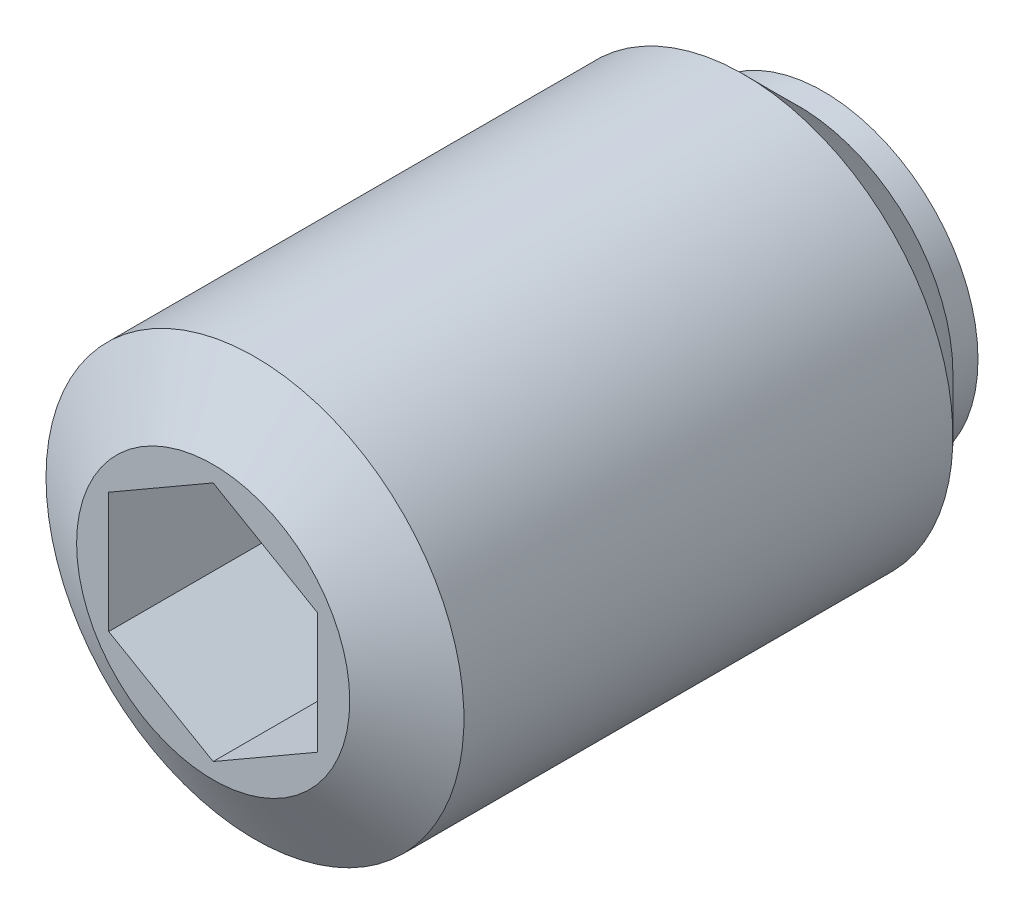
ISO-10303-21;
HEADER;
FILE_DESCRIPTION(('STEP AP214'),'2;1');
FILE_NAME('part.step','',(''),(''),'','','');
FILE_SCHEMA(('AUTOMOTIVE_DESIGN { 1 0 10303 214 1 1 1 1 }'));
ENDSEC;
DATA;
#1=APPLICATION_CONTEXT('core data for automotive mechanical design processes');
#2=APPLICATION_PROTOCOL_DEFINITION('international standard','automotive_design',2000,#1);
#3=PRODUCT_CONTEXT('',#1,'mechanical');
#4=PRODUCT('Part','Part','',(#3));
#5=PRODUCT_RELATED_PRODUCT_CATEGORY('part','',(#4));
#6=PRODUCT_DEFINITION_FORMATION('','',#4);
#7=PRODUCT_DEFINITION_CONTEXT('part definition',#1,'design');
#8=PRODUCT_DEFINITION('design','',#6,#7);
#9=PRODUCT_DEFINITION_SHAPE('','',#8);
#10=(LENGTH_UNIT() NAMED_UNIT(*) SI_UNIT(.MILLI.,.METRE.));
#11=(NAMED_UNIT(*) PLANE_ANGLE_UNIT() SI_UNIT($,.RADIAN.));
#12=(NAMED_UNIT(*) SI_UNIT($,.STERADIAN.) SOLID_ANGLE_UNIT());
#13=UNCERTAINTY_MEASURE_WITH_UNIT(LENGTH_MEASURE(1.E-05),#10,'distance_accuracy_value','');
#14=(GEOMETRIC_REPRESENTATION_CONTEXT(3) GLOBAL_UNCERTAINTY_ASSIGNED_CONTEXT((#13)) GLOBAL_UNIT_ASSIGNED_CONTEXT((#10,
#11,#12)) REPRESENTATION_CONTEXT('',''));
#15=CARTESIAN_POINT('',(0.,0.,0.));
#16=DIRECTION('',(0.,0.,1.));
#17=DIRECTION('',(1.,0.,0.));
#18=AXIS2_PLACEMENT_3D('',#15,#16,#17);
#19=CARTESIAN_POINT('',(0.,0.,1.5));
#20=DIRECTION('',(0.,0.,1.));
#21=DIRECTION('',(0.,-1.,0.));
#22=AXIS2_PLACEMENT_3D('',#19,#20,#21);
#23=SPHERICAL_SURFACE('',#22,1.5);
#24=CARTESIAN_POINT('',(0.,0.,0.7));
#25=DIRECTION('',(0.,0.,1.));
#26=DIRECTION('',(-1.,0.,0.));
#27=AXIS2_PLACEMENT_3D('',#24,#25,#26);
#28=CIRCLE('',#27,1.26885775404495);
#29=CARTESIAN_POINT('',(-1.26885775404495,0.,0.7));
#30=VERTEX_POINT('',#29);
#31=EDGE_CURVE('E9',#30,#30,#28,.T.);
#32=ORIENTED_EDGE('',*,*,#31,.F.);
#33=EDGE_LOOP('',(#32));
#34=FACE_BOUND('',#33,.T.);
#35=ADVANCED_FACE('F14',(#34),#23,.T.);
#36=CARTESIAN_POINT('',(0.,1.85,0.7));
#37=DIRECTION('',(0.,0.,1.));
#38=DIRECTION('',(-1.,0.,0.));
#39=AXIS2_PLACEMENT_3D('',#36,#37,#38);
#40=PLANE('',#39);
#41=CARTESIAN_POINT('',(0.,0.,0.7));
#42=DIRECTION('',(0.,0.,1.));
#43=DIRECTION('',(-1.,0.,0.));
#44=AXIS2_PLACEMENT_3D('',#41,#42,#43);
#45=CIRCLE('',#44,1.85);
#46=CARTESIAN_POINT('',(-1.85,0.,0.7));
#47=VERTEX_POINT('',#46);
#48=EDGE_CURVE('E21',#47,#47,#45,.T.);
#49=ORIENTED_EDGE('',*,*,#48,.F.);
#50=EDGE_LOOP('',(#49));
#51=FACE_BOUND('',#50,.T.);
#52=ORIENTED_EDGE('',*,*,#31,.T.);
#53=EDGE_LOOP('',(#52));
#54=FACE_BOUND('',#53,.T.);
#55=ADVANCED_FACE('F138',(#51,#54),#40,.F.);
#56=CARTESIAN_POINT('',(0.,0.,9.39507492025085));
#57=DIRECTION('',(0.,0.,1.));
#58=DIRECTION('',(-1.,0.,0.));
#59=AXIS2_PLACEMENT_3D('',#56,#57,#58);
#60=CYLINDRICAL_SURFACE('',#59,1.85);
#61=CARTESIAN_POINT('',(0.,0.,1.));
#62=DIRECTION('',(0.,0.,1.));
#63=DIRECTION('',(-1.,0.,0.));
#64=AXIS2_PLACEMENT_3D('',#61,#62,#63);
#65=CIRCLE('',#64,1.85);
#66=CARTESIAN_POINT('',(-1.85,0.,1.));
#67=VERTEX_POINT('',#66);
#68=EDGE_CURVE('E131',#67,#67,#65,.T.);
#69=ORIENTED_EDGE('',*,*,#68,.F.);
#70=EDGE_LOOP('',(#69));
#71=FACE_BOUND('',#70,.T.);
#72=ORIENTED_EDGE('',*,*,#48,.T.);
#73=EDGE_LOOP('',(#72));
#74=FACE_BOUND('',#73,.T.);
#75=ADVANCED_FACE('F136',(#71,#74),#60,.T.);
#76=CARTESIAN_POINT('',(0.,0.,1.));
#77=DIRECTION('',(0.,0.,1.));
#78=DIRECTION('',(-1.,0.,0.));
#79=AXIS2_PLACEMENT_3D('',#76,#77,#78);
#80=CONICAL_SURFACE('',#79,1.85,0.78539816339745);
#81=CARTESIAN_POINT('',(0.,0.,1.65));
#82=DIRECTION('',(0.,0.,1.));
#83=DIRECTION('',(-1.,0.,0.));
#84=AXIS2_PLACEMENT_3D('',#81,#82,#83);
#85=CIRCLE('',#84,2.5);
#86=CARTESIAN_POINT('',(-2.5,0.,1.65));
#87=VERTEX_POINT('',#86);
#88=EDGE_CURVE('E128',#87,#87,#85,.T.);
#89=ORIENTED_EDGE('',*,*,#88,.F.);
#90=EDGE_LOOP('',(#89));
#91=FACE_BOUND('',#90,.T.);
#92=ORIENTED_EDGE('',*,*,#68,.T.);
#93=EDGE_LOOP('',(#92));
#94=FACE_BOUND('',#93,.T.);
#95=ADVANCED_FACE('F161',(#91,#94),#80,.T.);
#96=CARTESIAN_POINT('',(0.,0.,9.39507492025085));
#97=DIRECTION('',(0.,0.,1.));
#98=DIRECTION('',(-1.,0.,0.));
#99=AXIS2_PLACEMENT_3D('',#96,#97,#98);
#100=CYLINDRICAL_SURFACE('',#99,2.5);
#101=CARTESIAN_POINT('',(0.,0.,7.5));
#102=DIRECTION('',(0.,0.,1.));
#103=DIRECTION('',(-1.,0.,0.));
#104=AXIS2_PLACEMENT_3D('',#101,#102,#103);
#105=CIRCLE('',#104,2.5);
#106=CARTESIAN_POINT('',(-2.5,0.,7.5));
#107=VERTEX_POINT('',#106);
#108=EDGE_CURVE('E125',#107,#107,#105,.T.);
#109=ORIENTED_EDGE('',*,*,#108,.F.);
#110=EDGE_LOOP('',(#109));
#111=FACE_BOUND('',#110,.T.);
#112=ORIENTED_EDGE('',*,*,#88,.T.);
#113=EDGE_LOOP('',(#112));
#114=FACE_BOUND('',#113,.T.);
#115=ADVANCED_FACE('F170',(#111,#114),#100,.T.);
#116=CARTESIAN_POINT('',(0.,0.,7.5));
#117=DIRECTION('',(0.,0.,-1.));
#118=DIRECTION('',(1.,0.,0.));
#119=AXIS2_PLACEMENT_3D('',#116,#117,#118);
#120=CONICAL_SURFACE('',#119,2.5,1.04719755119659);
#121=CARTESIAN_POINT('',(0.,0.,8.));
#122=DIRECTION('',(0.,0.,1.));
#123=DIRECTION('',(-1.,0.,0.));
#124=AXIS2_PLACEMENT_3D('',#121,#122,#123);
#125=CIRCLE('',#124,1.63397459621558);
#126=CARTESIAN_POINT('',(-1.63397459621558,0.,8.));
#127=VERTEX_POINT('',#126);
#128=EDGE_CURVE('E116',#127,#127,#125,.T.);
#129=ORIENTED_EDGE('',*,*,#128,.F.);
#130=EDGE_LOOP('',(#129));
#131=FACE_BOUND('',#130,.T.);
#132=ORIENTED_EDGE('',*,*,#108,.T.);
#133=EDGE_LOOP('',(#132));
#134=FACE_BOUND('',#133,.T.);
#135=ADVANCED_FACE('F179',(#131,#134),#120,.T.);
#136=CARTESIAN_POINT('',(0.,0.,8.));
#137=DIRECTION('',(0.,0.,-1.));
#138=DIRECTION('',(1.,0.,0.));
#139=AXIS2_PLACEMENT_3D('',#136,#137,#138);
#140=PLANE('',#139);
#141=DIRECTION('',(-0.866025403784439,-0.5,0.));
#142=VECTOR('',#141,1.);
#143=CARTESIAN_POINT('',(0.,1.44337567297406,8.));
#144=LINE('',#143,#142);
#145=CARTESIAN_POINT('',(0.,1.44337567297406,8.));
#146=VERTEX_POINT('',#145);
#147=CARTESIAN_POINT('',(-1.25,0.721687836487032,8.));
#148=VERTEX_POINT('',#147);
#149=EDGE_CURVE('E82',#146,#148,#144,.T.);
#150=ORIENTED_EDGE('',*,*,#149,.F.);
#151=DIRECTION('',(-0.866025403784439,0.5,0.));
#152=VECTOR('',#151,1.);
#153=CARTESIAN_POINT('',(1.25,0.721687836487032,8.));
#154=LINE('',#153,#152);
#155=CARTESIAN_POINT('',(1.25,0.721687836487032,8.));
#156=VERTEX_POINT('',#155);
#157=EDGE_CURVE('E28',#156,#146,#154,.T.);
#158=ORIENTED_EDGE('',*,*,#157,.F.);
#159=DIRECTION('',(0.,1.,0.));
#160=VECTOR('',#159,1.);
#161=CARTESIAN_POINT('',(1.25,-0.721687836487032,8.));
#162=LINE('',#161,#160);
#163=CARTESIAN_POINT('',(1.25,-0.721687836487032,8.));
#164=VERTEX_POINT('',#163);
#165=EDGE_CURVE('E98',#164,#156,#162,.T.);
#166=ORIENTED_EDGE('',*,*,#165,.F.);
#167=DIRECTION('',(0.866025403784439,0.5,0.));
#168=VECTOR('',#167,1.);
#169=CARTESIAN_POINT('',(0.,-1.44337567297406,8.));
#170=LINE('',#169,#168);
#171=CARTESIAN_POINT('',(0.,-1.44337567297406,8.));
#172=VERTEX_POINT('',#171);
#173=EDGE_CURVE('E92',#172,#164,#170,.T.);
#174=ORIENTED_EDGE('',*,*,#173,.F.);
#175=DIRECTION('',(0.866025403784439,-0.5,0.));
#176=VECTOR('',#175,1.);
#177=CARTESIAN_POINT('',(-1.25,-0.721687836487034,8.));
#178=LINE('',#177,#176);
#179=CARTESIAN_POINT('',(-1.25,-0.721687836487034,8.));
#180=VERTEX_POINT('',#179);
#181=EDGE_CURVE('E90',#180,#172,#178,.T.);
#182=ORIENTED_EDGE('',*,*,#181,.F.);
#183=DIRECTION('',(0.,-1.,0.));
#184=VECTOR('',#183,1.);
#185=CARTESIAN_POINT('',(-1.25,0.721687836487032,8.));
#186=LINE('',#185,#184);
#187=EDGE_CURVE('E71',#148,#180,#186,.T.);
#188=ORIENTED_EDGE('',*,*,#187,.F.);
#189=EDGE_LOOP('',(#150,#158,#166,#174,#182,#188));
#190=FACE_BOUND('',#189,.T.);
#191=ORIENTED_EDGE('',*,*,#128,.T.);
#192=EDGE_LOOP('',(#191));
#193=FACE_BOUND('',#192,.T.);
#194=ADVANCED_FACE('F86',(#190,#193),#140,.F.);
#195=CARTESIAN_POINT('',(1.25,0.721687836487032,5.));
#196=DIRECTION('',(0.5,0.866025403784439,0.));
#197=DIRECTION('',(0.866025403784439,-0.5,0.));
#198=AXIS2_PLACEMENT_3D('',#195,#196,#197);
#199=PLANE('',#198);
#200=ORIENTED_EDGE('',*,*,#157,.T.);
#201=DIRECTION('',(0.,0.,1.));
#202=VECTOR('',#201,1.);
#203=CARTESIAN_POINT('',(0.,1.44337567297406,5.));
#204=LINE('',#203,#202);
#205=CARTESIAN_POINT('',(0.,1.44337567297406,5.));
#206=VERTEX_POINT('',#205);
#207=EDGE_CURVE('E79',#206,#146,#204,.T.);
#208=ORIENTED_EDGE('',*,*,#207,.F.);
#209=DIRECTION('',(-0.866025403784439,0.5,0.));
#210=VECTOR('',#209,1.);
#211=CARTESIAN_POINT('',(1.25,0.721687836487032,5.));
#212=LINE('',#211,#210);
#213=CARTESIAN_POINT('',(1.25,0.721687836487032,5.));
#214=VERTEX_POINT('',#213);
#215=EDGE_CURVE('E100',#214,#206,#212,.T.);
#216=ORIENTED_EDGE('',*,*,#215,.F.);
#217=DIRECTION('',(0.,0.,1.));
#218=VECTOR('',#217,1.);
#219=CARTESIAN_POINT('',(1.25,0.721687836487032,5.));
#220=LINE('',#219,#218);
#221=EDGE_CURVE('E35',#214,#156,#220,.T.);
#222=ORIENTED_EDGE('',*,*,#221,.T.);
#223=EDGE_LOOP('',(#200,#208,#216,#222));
#224=FACE_BOUND('',#223,.T.);
#225=ADVANCED_FACE('F196',(#224),#199,.F.);
#226=CARTESIAN_POINT('',(1.25,-0.721687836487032,5.));
#227=DIRECTION('',(1.,0.,0.));
#228=DIRECTION('',(0.,-1.,0.));
#229=AXIS2_PLACEMENT_3D('',#226,#227,#228);
#230=PLANE('',#229);
#231=ORIENTED_EDGE('',*,*,#165,.T.);
#232=ORIENTED_EDGE('',*,*,#221,.F.);
#233=DIRECTION('',(0.,1.,0.));
#234=VECTOR('',#233,1.);
#235=CARTESIAN_POINT('',(1.25,-0.721687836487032,5.));
#236=LINE('',#235,#234);
#237=CARTESIAN_POINT('',(1.25,-0.721687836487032,5.));
#238=VERTEX_POINT('',#237);
#239=EDGE_CURVE('E112',#238,#214,#236,.T.);
#240=ORIENTED_EDGE('',*,*,#239,.F.);
#241=DIRECTION('',(0.,0.,1.));
#242=VECTOR('',#241,1.);
#243=CARTESIAN_POINT('',(1.25,-0.721687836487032,5.));
#244=LINE('',#243,#242);
#245=EDGE_CURVE('E117',#238,#164,#244,.T.);
#246=ORIENTED_EDGE('',*,*,#245,.T.);
#247=EDGE_LOOP('',(#231,#232,#240,#246));
#248=FACE_BOUND('',#247,.T.);
#249=ADVANCED_FACE('F204',(#248),#230,.F.);
#250=CARTESIAN_POINT('',(0.,-1.44337567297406,5.));
#251=DIRECTION('',(0.5,-0.866025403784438,0.));
#252=DIRECTION('',(-0.866025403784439,-0.5,0.));
#253=AXIS2_PLACEMENT_3D('',#250,#251,#252);
#254=PLANE('',#253);
#255=ORIENTED_EDGE('',*,*,#173,.T.);
#256=ORIENTED_EDGE('',*,*,#245,.F.);
#257=DIRECTION('',(0.866025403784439,0.5,0.));
#258=VECTOR('',#257,1.);
#259=CARTESIAN_POINT('',(0.,-1.44337567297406,5.));
#260=LINE('',#259,#258);
#261=CARTESIAN_POINT('',(0.,-1.44337567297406,5.));
#262=VERTEX_POINT('',#261);
#263=EDGE_CURVE('E109',#262,#238,#260,.T.);
#264=ORIENTED_EDGE('',*,*,#263,.F.);
#265=DIRECTION('',(0.,0.,1.));
#266=VECTOR('',#265,1.);
#267=CARTESIAN_POINT('',(0.,-1.44337567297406,5.));
#268=LINE('',#267,#266);
#269=EDGE_CURVE('E119',#262,#172,#268,.T.);
#270=ORIENTED_EDGE('',*,*,#269,.T.);
#271=EDGE_LOOP('',(#255,#256,#264,#270));
#272=FACE_BOUND('',#271,.T.);
#273=ADVANCED_FACE('F212',(#272),#254,.F.);
#274=CARTESIAN_POINT('',(-1.25,-0.721687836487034,5.));
#275=DIRECTION('',(-0.5,-0.866025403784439,0.));
#276=DIRECTION('',(-0.866025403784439,0.5,0.));
#277=AXIS2_PLACEMENT_3D('',#274,#275,#276);
#278=PLANE('',#277);
#279=ORIENTED_EDGE('',*,*,#181,.T.);
#280=ORIENTED_EDGE('',*,*,#269,.F.);
#281=DIRECTION('',(0.866025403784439,-0.5,0.));
#282=VECTOR('',#281,1.);
#283=CARTESIAN_POINT('',(-1.25,-0.721687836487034,5.));
#284=LINE('',#283,#282);
#285=CARTESIAN_POINT('',(-1.25,-0.721687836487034,5.));
#286=VERTEX_POINT('',#285);
#287=EDGE_CURVE('E106',#286,#262,#284,.T.);
#288=ORIENTED_EDGE('',*,*,#287,.F.);
#289=DIRECTION('',(0.,0.,1.));
#290=VECTOR('',#289,1.);
#291=CARTESIAN_POINT('',(-1.25,-0.721687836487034,5.));
#292=LINE('',#291,#290);
#293=EDGE_CURVE('E78',#286,#180,#292,.T.);
#294=ORIENTED_EDGE('',*,*,#293,.T.);
#295=EDGE_LOOP('',(#279,#280,#288,#294));
#296=FACE_BOUND('',#295,.T.);
#297=ADVANCED_FACE('F220',(#296),#278,.F.);
#298=CARTESIAN_POINT('',(-1.25,0.721687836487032,5.));
#299=DIRECTION('',(-1.,0.,0.));
#300=DIRECTION('',(0.,1.,0.));
#301=AXIS2_PLACEMENT_3D('',#298,#299,#300);
#302=PLANE('',#301);
#303=ORIENTED_EDGE('',*,*,#187,.T.);
#304=ORIENTED_EDGE('',*,*,#293,.F.);
#305=DIRECTION('',(0.,-1.,0.));
#306=VECTOR('',#305,1.);
#307=CARTESIAN_POINT('',(-1.25,0.721687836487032,5.));
#308=LINE('',#307,#306);
#309=CARTESIAN_POINT('',(-1.25,0.721687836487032,5.));
#310=VERTEX_POINT('',#309);
#311=EDGE_CURVE('E74',#310,#286,#308,.T.);
#312=ORIENTED_EDGE('',*,*,#311,.F.);
#313=DIRECTION('',(0.,0.,1.));
#314=VECTOR('',#313,1.);
#315=CARTESIAN_POINT('',(-1.25,0.721687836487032,5.));
#316=LINE('',#315,#314);
#317=EDGE_CURVE('E67',#310,#148,#316,.T.);
#318=ORIENTED_EDGE('',*,*,#317,.T.);
#319=EDGE_LOOP('',(#303,#304,#312,#318));
#320=FACE_BOUND('',#319,.T.);
#321=ADVANCED_FACE('F69',(#320),#302,.F.);
#322=CARTESIAN_POINT('',(0.,1.44337567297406,5.));
#323=DIRECTION('',(-0.5,0.866025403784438,0.));
#324=DIRECTION('',(0.866025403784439,0.5,0.));
#325=AXIS2_PLACEMENT_3D('',#322,#323,#324);
#326=PLANE('',#325);
#327=ORIENTED_EDGE('',*,*,#149,.T.);
#328=ORIENTED_EDGE('',*,*,#317,.F.);
#329=DIRECTION('',(-0.866025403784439,-0.5,0.));
#330=VECTOR('',#329,1.);
#331=CARTESIAN_POINT('',(0.,1.44337567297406,5.));
#332=LINE('',#331,#330);
#333=EDGE_CURVE('E103',#206,#310,#332,.T.);
#334=ORIENTED_EDGE('',*,*,#333,.F.);
#335=ORIENTED_EDGE('',*,*,#207,.T.);
#336=EDGE_LOOP('',(#327,#328,#334,#335));
#337=FACE_BOUND('',#336,.T.);
#338=ADVANCED_FACE('F83',(#337),#326,.F.);
#339=CARTESIAN_POINT('',(2.5,0.,5.));
#340=DIRECTION('',(0.,0.,-1.));
#341=DIRECTION('',(1.,0.,0.));
#342=AXIS2_PLACEMENT_3D('',#339,#340,#341);
#343=PLANE('',#342);
#344=ORIENTED_EDGE('',*,*,#215,.T.);
#345=ORIENTED_EDGE('',*,*,#333,.T.);
#346=ORIENTED_EDGE('',*,*,#311,.T.);
#347=ORIENTED_EDGE('',*,*,#287,.T.);
#348=ORIENTED_EDGE('',*,*,#263,.T.);
#349=ORIENTED_EDGE('',*,*,#239,.T.);
#350=EDGE_LOOP('',(#344,#345,#346,#347,#348,#349));
#351=FACE_BOUND('',#350,.T.);
#352=ADVANCED_FACE('F244',(#351),#343,.F.);
#353=CLOSED_SHELL('',(#35,#55,#75,#95,#115,#135,#194,#225,#249,#273,#297,#321,#338,#352));
#354=MANIFOLD_SOLID_BREP('B1',#353);
#355=ADVANCED_BREP_SHAPE_REPRESENTATION('',(#18,#354),#14);
#356=SHAPE_DEFINITION_REPRESENTATION(#9,#355);
ENDSEC;
END-ISO-10303-21;
